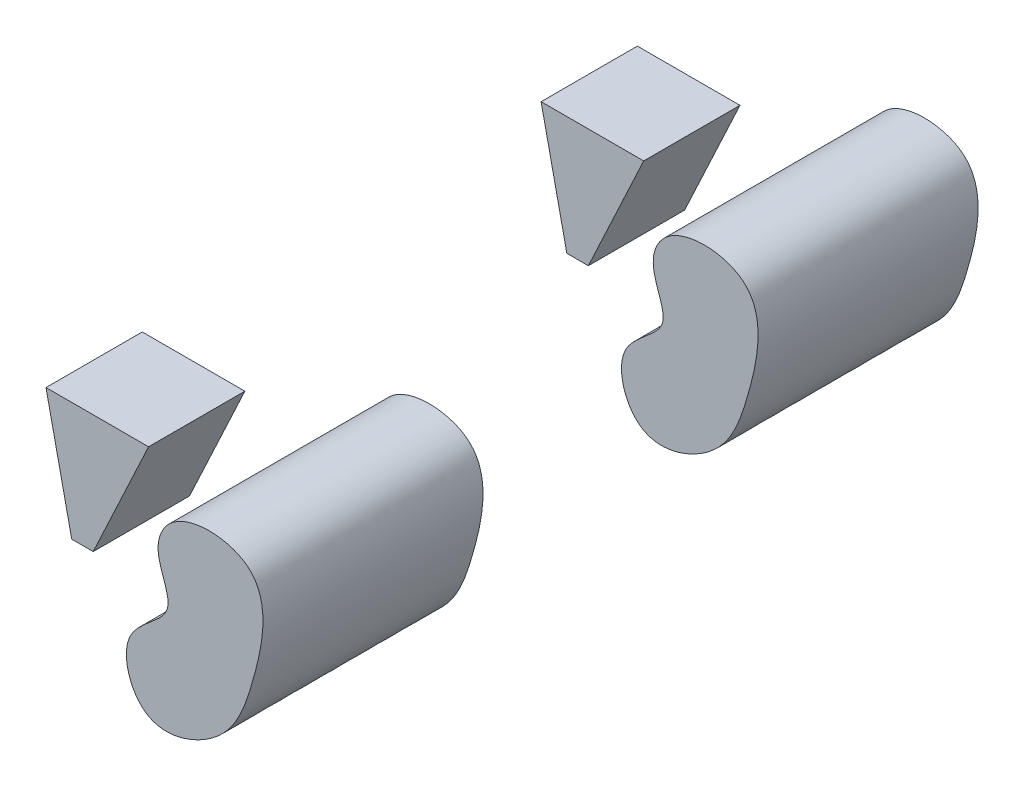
from build123d import *

# Parameters (mm, degrees)
BOSS_EXTRUDE1_DEPTH = 35
BOSS_EXTRUDE2_DEPTH = 80


with BuildPart() as part:
    # Sketch1 → Boss-Extrude1 (new, symmetric)
    with BuildSketch(Plane.XY):
        Polygon((0, 0), (15.621559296, 0), (55.883764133, 86.142391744), (-18.709600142, 86.142391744), align=None)
    extrude(amount=BOSS_EXTRUDE1_DEPTH, both=True)


with BuildPart() as body_2:
    # Sketch2 → Boss-Extrude2 (new, symmetric)
    with BuildSketch(Plane.XY):
        with BuildLine():
            add(Edge.make_bspline(
                [(99.580661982, -37.757547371), (87.127168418, -29.816226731), (74.552887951, 11.009477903), (127.059717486, 31.311204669), (102.985048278, 65.764538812), (118.203317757, 104.130129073), (195.636063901, 102.40392133), (178.512602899, 22.148093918), (159.354956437, -29.795094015), (113.687056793, -46.752887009), (99.580661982, -37.757547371)],
                knots=[0, 0, 0, 0, 0.119501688, 0.229795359, 0.319285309, 0.375456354, 0.529925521, 0.715062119, 0.864637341, 1, 1, 1, 1], degree=3))
        make_face()
    extrude(amount=BOSS_EXTRUDE2_DEPTH, both=True)


with BuildPart() as body_3:
    # Mirror1: mirrored copy
    add(body_2.part.mirror(Plane.XY.offset(180)))


with BuildPart() as body_4:
    # Mirror1 2: mirrored copy
    add(part.part.mirror(Plane.XY.offset(180)))


solid = Compound([part.part, body_2.part, body_3.part, body_4.part])
